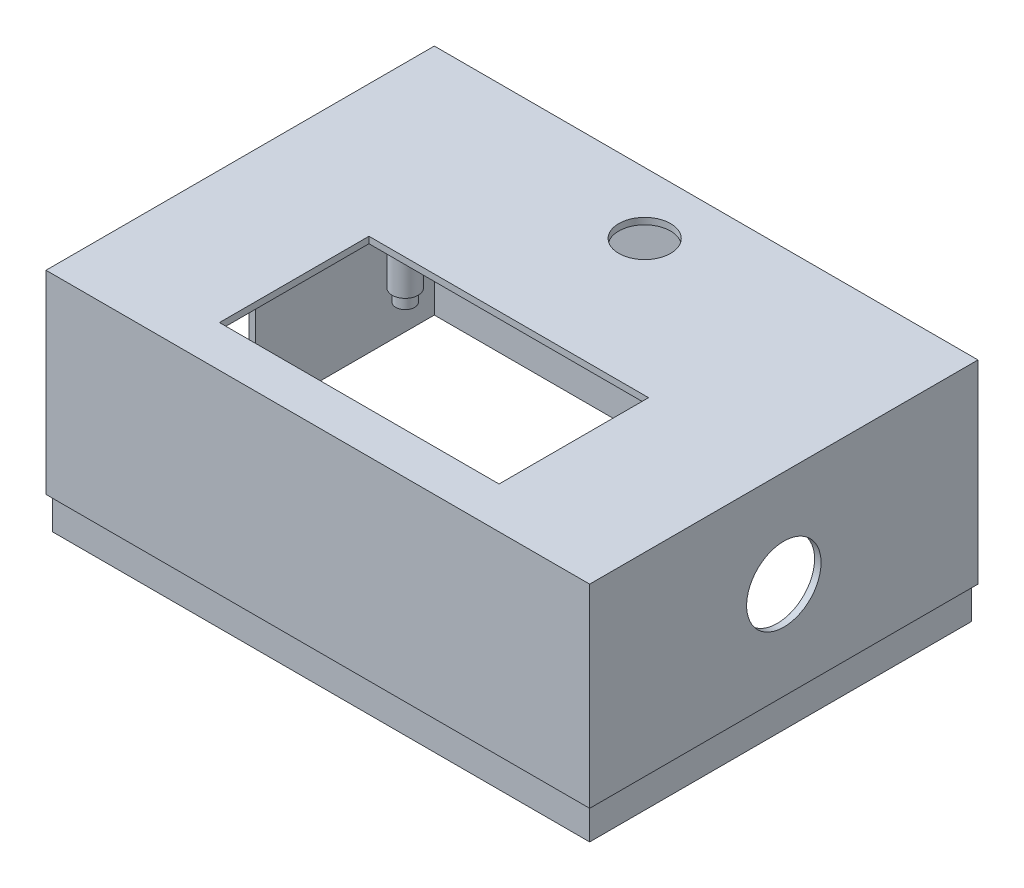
from build123d import *

# Parameters (mm, degrees)
SKETCH27_W                     = 84
SKETCH27_H                     = 60
BOSS_EXTRUDE1_DEPTH            = 30
SKETCH28_W                     = 83
SKETCH28_H                     = 59
BOSS_EXTRUDE2_DEPTH            = 5
SKETCH29_W                     = 82
SKETCH29_H                     = 58
CUT_EXTRUDE2_DEPTH             = 34
SKETCH38_W                     = 43.2
SKETCH38_H                     = 23.1
CUT_EXTRUDE3_DEPTH             = 1
SKETCH40_R                     = 4
CUT_EXTRUDE5_DEPTH             = 1
SKETCH46_R                     = 2
BOSS_EXTRUDE3_DEPTH            = 23.1
SKETCH48_R                     = 1.45
BOSS_EXTRUDE4_DEPTH            = 1.9
F_4_40_TAPPED_HOLE2_AT_2_COUNT = 2
F_4_40_TAPPED_HOLE2_AT_2_PITCH = 69
F_4_40_TAPPED_HOLE2_AT_3_COUNT = 2
F_4_40_TAPPED_HOLE2_AT_3_PITCH = 69
F_4_40_TAPPED_HOLE2_AT_4_COUNT = 2
F_4_40_TAPPED_HOLE2_AT_4_PITCH = 69
F_4_40_TAPPED_HOLE2_AT_5_COUNT = 2
F_4_40_TAPPED_HOLE2_AT_5_PITCH = 79.014239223
F_4_40_TAPPED_HOLE2_AT_6_COUNT = 2
F_4_40_TAPPED_HOLE2_AT_6_PITCH = 79.014239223
F_4_40_TAPPED_HOLE2_AT_7_COUNT = 2
F_4_40_TAPPED_HOLE2_AT_7_PITCH = 38.5
SKETCH57_W                     = 13
SKETCH57_H                     = 8
CUT_EXTRUDE6_DEPTH             = 1
SKETCH58_R                     = 5.75
CUT_EXTRUDE7_DEPTH             = 1


with BuildPart() as part:
    # Sketch27 → Boss-Extrude1 (new body)
    with BuildSketch(Plane(origin=(0, 0, 0), x_dir=(1, 0, 0), z_dir=(0, 1, 0))):
        with Locations((42, 30)):
            Rectangle(SKETCH27_W, SKETCH27_H)
    extrude(amount=BOSS_EXTRUDE1_DEPTH)

    # Sketch28 → Boss-Extrude2 (add)
    with BuildSketch(Plane.XZ):
        with Locations((42, -30)):
            Rectangle(SKETCH28_W, SKETCH28_H)
    extrude(amount=BOSS_EXTRUDE2_DEPTH)

    # Sketch29 → Cut-Extrude2 (cut)
    with BuildSketch(Plane.XZ.offset(5)):
        with Locations((42, -30)):
            Rectangle(SKETCH29_W, SKETCH29_H)
    extrude(amount=-CUT_EXTRUDE2_DEPTH, mode=Mode.SUBTRACT)

    # Sketch38 → Cut-Extrude3 (cut)
    with BuildSketch(Plane(origin=(0, 30, 0), x_dir=(1, 0, 0), z_dir=(0, 1, 0))):
        with Locations((42, 17.95)):
            Rectangle(SKETCH38_W, SKETCH38_H)
    extrude(amount=-CUT_EXTRUDE3_DEPTH, mode=Mode.SUBTRACT)

    # Sketch40 → Cut-Extrude5 (cut)
    with BuildSketch(Plane(origin=(0, 30, 0), x_dir=(1, 0, 0), z_dir=(0, 1, 0))):
        with Locations(Location((42, 50.5, 0), (0, 0, 270))):
            Circle(SKETCH40_R)
    extrude(amount=-CUT_EXTRUDE5_DEPTH, mode=Mode.SUBTRACT)

    # Sketch46 → Boss-Extrude3 (add)
    with BuildSketch(Plane.XZ.offset(-29)):
        with Locations(Location((6, -49.5, 0), (0, 0, 90))):
            Circle(SKETCH46_R)
        with Locations(Location((6, -11, 0), (0, 0, 90))):
            Circle(SKETCH46_R)
        with Locations(Location((75, -11, 0), (0, 0, 90))):
            Circle(SKETCH46_R)
        with Locations(Location((75, -49.5, 0), (0, 0, 90))):
            Circle(SKETCH46_R)
    extrude(amount=BOSS_EXTRUDE3_DEPTH)

    # Sketch48 → Boss-Extrude4 (add)
    with BuildSketch(Plane.XZ.offset(-5.9)):
        with Locations(Location((6, -11, 0), (0, 0, 90))):
            Circle(SKETCH48_R)
        with Locations(Location((6, -49.5, 0), (0, 0, 90))):
            Circle(SKETCH48_R)
        with Locations(Location((75, -49.5, 0), (0, 0, 90))):
            Circle(SKETCH48_R)
        with Locations(Location((75, -11, 0), (0, 0, 90))):
            Circle(SKETCH48_R)
    extrude(amount=BOSS_EXTRUDE4_DEPTH)

    # Sketch54 → 4-40 Tapped Hole2 (revolve, cut)
    with BuildSketch(Plane(origin=(75, 4, -11), x_dir=(0, 0, -1), z_dir=(1, 0, 0))):
        Polygon((0, 0), (0, 7.029152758), (1.1303, 6.35), (1.1303, 0), align=None)
    f_4_40_tapped_hole2 = revolve(axis=Axis((75, -2.35, -11), (0, 1, 0)), mode=Mode.SUBTRACT)

    # 4-40 Tapped Hole2 at 2: 4-40 Tapped Hole2 ×2
    with Locations(*[(-i * F_4_40_TAPPED_HOLE2_AT_2_PITCH, 0, 0) for i in range(1, F_4_40_TAPPED_HOLE2_AT_2_COUNT)]):
        add(f_4_40_tapped_hole2, mode=Mode.SUBTRACT)

    # 4-40 Tapped Hole2 at 3: 4-40 Tapped Hole2 ×2
    with Locations(*[(-i * F_4_40_TAPPED_HOLE2_AT_3_PITCH, 0, 0) for i in range(1, F_4_40_TAPPED_HOLE2_AT_3_COUNT)]):
        add(f_4_40_tapped_hole2, mode=Mode.SUBTRACT)

    # 4-40 Tapped Hole2 at 4: 4-40 Tapped Hole2 ×2
    with Locations(*[(-i * F_4_40_TAPPED_HOLE2_AT_4_PITCH, 0, 0) for i in range(1, F_4_40_TAPPED_HOLE2_AT_4_COUNT)]):
        add(f_4_40_tapped_hole2, mode=Mode.SUBTRACT)

    # 4-40 Tapped Hole2 at 5: 4-40 Tapped Hole2 ×2
    with Locations(*[Vector(-0.8732603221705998, 0, -0.4872539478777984) * (i * F_4_40_TAPPED_HOLE2_AT_5_PITCH) for i in range(1, F_4_40_TAPPED_HOLE2_AT_5_COUNT)]):
        add(f_4_40_tapped_hole2, mode=Mode.SUBTRACT)

    # 4-40 Tapped Hole2 at 6: 4-40 Tapped Hole2 ×2
    with Locations(*[Vector(-0.8732603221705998, 0, -0.4872539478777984) * (i * F_4_40_TAPPED_HOLE2_AT_6_PITCH) for i in range(1, F_4_40_TAPPED_HOLE2_AT_6_COUNT)]):
        add(f_4_40_tapped_hole2, mode=Mode.SUBTRACT)

    # 4-40 Tapped Hole2 at 7: 4-40 Tapped Hole2 ×2
    with Locations(*[(0, 0, -i * F_4_40_TAPPED_HOLE2_AT_7_PITCH) for i in range(1, F_4_40_TAPPED_HOLE2_AT_7_COUNT)]):
        add(f_4_40_tapped_hole2, mode=Mode.SUBTRACT)

    # Sketch57 → Cut-Extrude6 (cut)
    with BuildSketch(Plane.ZY):
        with Locations((-24.9, 5.9)):
            Rectangle(SKETCH57_W, SKETCH57_H)
    extrude(amount=-CUT_EXTRUDE6_DEPTH, mode=Mode.SUBTRACT)

    # Sketch58 → Cut-Extrude7 (cut)
    with BuildSketch(Plane(origin=(84, 0, 0), x_dir=(0, 0, -1), z_dir=(1, 0, 0))):
        with Locations((30, 15)):
            Circle(SKETCH58_R)
    extrude(amount=-CUT_EXTRUDE7_DEPTH, mode=Mode.SUBTRACT)


solid = part.part
